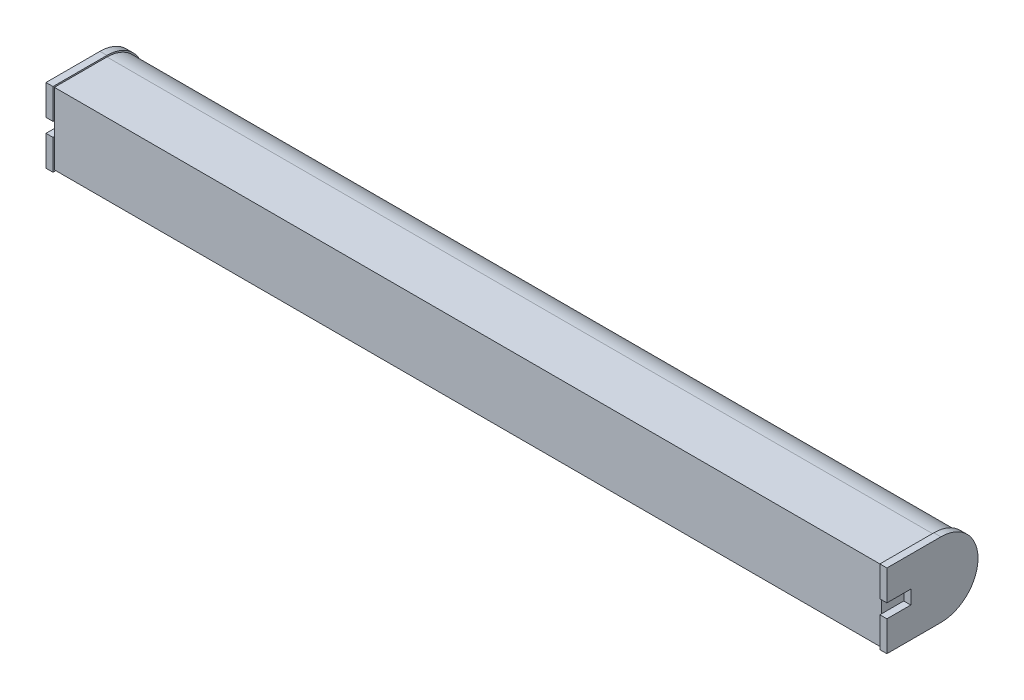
ISO-10303-21;
HEADER;
FILE_DESCRIPTION(('STEP AP214'),'2;1');
FILE_NAME('part.step','',(''),(''),'','','');
FILE_SCHEMA(('AUTOMOTIVE_DESIGN { 1 0 10303 214 1 1 1 1 }'));
ENDSEC;
DATA;
#1=APPLICATION_CONTEXT('core data for automotive mechanical design processes');
#2=APPLICATION_PROTOCOL_DEFINITION('international standard','automotive_design',2000,#1);
#3=PRODUCT_CONTEXT('',#1,'mechanical');
#4=PRODUCT('Part','Part','',(#3));
#5=PRODUCT_RELATED_PRODUCT_CATEGORY('part','',(#4));
#6=PRODUCT_DEFINITION_FORMATION('','',#4);
#7=PRODUCT_DEFINITION_CONTEXT('part definition',#1,'design');
#8=PRODUCT_DEFINITION('design','',#6,#7);
#9=PRODUCT_DEFINITION_SHAPE('','',#8);
#10=(LENGTH_UNIT() NAMED_UNIT(*) SI_UNIT(.MILLI.,.METRE.));
#11=(NAMED_UNIT(*) PLANE_ANGLE_UNIT() SI_UNIT($,.RADIAN.));
#12=(NAMED_UNIT(*) SI_UNIT($,.STERADIAN.) SOLID_ANGLE_UNIT());
#13=UNCERTAINTY_MEASURE_WITH_UNIT(LENGTH_MEASURE(1.E-05),#10,'distance_accuracy_value','');
#14=(GEOMETRIC_REPRESENTATION_CONTEXT(3) GLOBAL_UNCERTAINTY_ASSIGNED_CONTEXT((#13)) GLOBAL_UNIT_ASSIGNED_CONTEXT((#10,
#11,#12)) REPRESENTATION_CONTEXT('',''));
#15=CARTESIAN_POINT('',(0.,0.,0.));
#16=DIRECTION('',(0.,0.,1.));
#17=DIRECTION('',(1.,0.,0.));
#18=AXIS2_PLACEMENT_3D('',#15,#16,#17);
#19=CARTESIAN_POINT('',(5.,0.,-12.7681159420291));
#20=DIRECTION('',(-1.,0.,0.));
#21=DIRECTION('',(0.,0.,1.));
#22=AXIS2_PLACEMENT_3D('',#19,#20,#21);
#23=CYLINDRICAL_SURFACE('',#22,26.5);
#24=CARTESIAN_POINT('',(0.,0.,-12.7681159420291));
#25=DIRECTION('',(1.,0.,0.));
#26=DIRECTION('',(0.,0.,-1.));
#27=AXIS2_PLACEMENT_3D('',#24,#25,#26);
#28=CIRCLE('',#27,26.5);
#29=CARTESIAN_POINT('',(0.,-26.5,-12.7681159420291));
#30=VERTEX_POINT('',#29);
#31=CARTESIAN_POINT('',(0.,26.5,-12.7681159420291));
#32=VERTEX_POINT('',#31);
#33=EDGE_CURVE('E338',#30,#32,#28,.T.);
#34=ORIENTED_EDGE('',*,*,#33,.T.);
#35=DIRECTION('',(-1.,0.,0.));
#36=VECTOR('',#35,1.);
#37=CARTESIAN_POINT('',(5.,26.5,-12.7681159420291));
#38=LINE('',#37,#36);
#39=CARTESIAN_POINT('',(5.,26.5,-12.7681159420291));
#40=VERTEX_POINT('',#39);
#41=EDGE_CURVE('E42',#40,#32,#38,.T.);
#42=ORIENTED_EDGE('',*,*,#41,.F.);
#43=CARTESIAN_POINT('',(5.,0.,-12.7681159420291));
#44=DIRECTION('',(1.,0.,0.));
#45=DIRECTION('',(0.,0.,-1.));
#46=AXIS2_PLACEMENT_3D('',#43,#44,#45);
#47=CIRCLE('',#46,26.5);
#48=CARTESIAN_POINT('',(5.,-26.5,-12.7681159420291));
#49=VERTEX_POINT('',#48);
#50=EDGE_CURVE('E339',#49,#40,#47,.T.);
#51=ORIENTED_EDGE('',*,*,#50,.F.);
#52=DIRECTION('',(-1.,0.,0.));
#53=VECTOR('',#52,1.);
#54=CARTESIAN_POINT('',(5.,-26.5,-12.7681159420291));
#55=LINE('',#54,#53);
#56=EDGE_CURVE('E370',#49,#30,#55,.T.);
#57=ORIENTED_EDGE('',*,*,#56,.T.);
#58=EDGE_LOOP('',(#34,#42,#51,#57));
#59=FACE_BOUND('',#58,.T.);
#60=ADVANCED_FACE('F39',(#59),#23,.T.);
#61=CARTESIAN_POINT('',(5.,26.5,25.7318840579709));
#62=DIRECTION('',(0.,-1.,0.));
#63=DIRECTION('',(0.,0.,-1.));
#64=AXIS2_PLACEMENT_3D('',#61,#62,#63);
#65=PLANE('',#64);
#66=DIRECTION('',(0.,0.,1.));
#67=VECTOR('',#66,1.);
#68=CARTESIAN_POINT('',(0.,26.5,25.7318840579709));
#69=LINE('',#68,#67);
#70=CARTESIAN_POINT('',(0.,26.5,25.7318840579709));
#71=VERTEX_POINT('',#70);
#72=EDGE_CURVE('E374',#32,#71,#69,.T.);
#73=ORIENTED_EDGE('',*,*,#72,.T.);
#74=DIRECTION('',(-1.,0.,0.));
#75=VECTOR('',#74,1.);
#76=CARTESIAN_POINT('',(5.,26.5,25.7318840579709));
#77=LINE('',#76,#75);
#78=CARTESIAN_POINT('',(5.,26.5,25.7318840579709));
#79=VERTEX_POINT('',#78);
#80=EDGE_CURVE('E416',#79,#71,#77,.T.);
#81=ORIENTED_EDGE('',*,*,#80,.F.);
#82=DIRECTION('',(0.,0.,1.));
#83=VECTOR('',#82,1.);
#84=CARTESIAN_POINT('',(5.,26.5,25.7318840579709));
#85=LINE('',#84,#83);
#86=EDGE_CURVE('E343',#40,#79,#85,.T.);
#87=ORIENTED_EDGE('',*,*,#86,.F.);
#88=ORIENTED_EDGE('',*,*,#41,.T.);
#89=EDGE_LOOP('',(#73,#81,#87,#88));
#90=FACE_BOUND('',#89,.T.);
#91=ADVANCED_FACE('F486',(#90),#65,.F.);
#92=CARTESIAN_POINT('',(5.,4.91972353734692,25.7318840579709));
#93=DIRECTION('',(0.,0.,-1.));
#94=DIRECTION('',(-1.,0.,0.));
#95=AXIS2_PLACEMENT_3D('',#92,#93,#94);
#96=PLANE('',#95);
#97=DIRECTION('',(0.,-1.,0.));
#98=VECTOR('',#97,1.);
#99=CARTESIAN_POINT('',(0.,4.91972353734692,25.7318840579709));
#100=LINE('',#99,#98);
#101=CARTESIAN_POINT('',(0.,4.91972353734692,25.7318840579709));
#102=VERTEX_POINT('',#101);
#103=EDGE_CURVE('E377',#71,#102,#100,.T.);
#104=ORIENTED_EDGE('',*,*,#103,.T.);
#105=DIRECTION('',(-1.,0.,0.));
#106=VECTOR('',#105,1.);
#107=CARTESIAN_POINT('',(5.,4.91972353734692,25.7318840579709));
#108=LINE('',#107,#106);
#109=CARTESIAN_POINT('',(5.,4.91972353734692,25.7318840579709));
#110=VERTEX_POINT('',#109);
#111=EDGE_CURVE('E413',#110,#102,#108,.T.);
#112=ORIENTED_EDGE('',*,*,#111,.F.);
#113=DIRECTION('',(0.,-1.,0.));
#114=VECTOR('',#113,1.);
#115=CARTESIAN_POINT('',(5.,4.91972353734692,25.7318840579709));
#116=LINE('',#115,#114);
#117=EDGE_CURVE('E347',#79,#110,#116,.T.);
#118=ORIENTED_EDGE('',*,*,#117,.F.);
#119=ORIENTED_EDGE('',*,*,#80,.T.);
#120=EDGE_LOOP('',(#104,#112,#118,#119));
#121=FACE_BOUND('',#120,.T.);
#122=ADVANCED_FACE('F491',(#121),#96,.F.);
#123=CARTESIAN_POINT('',(5.,4.91972353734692,25.7318840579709));
#124=DIRECTION('',(0.,1.,0.));
#125=DIRECTION('',(0.,0.,1.));
#126=AXIS2_PLACEMENT_3D('',#123,#124,#125);
#127=PLANE('',#126);
#128=DIRECTION('',(0.,0.,-1.));
#129=VECTOR('',#128,1.);
#130=CARTESIAN_POINT('',(0.,4.91972353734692,25.7318840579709));
#131=LINE('',#130,#129);
#132=CARTESIAN_POINT('',(0.,4.91972353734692,8.69894669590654));
#133=VERTEX_POINT('',#132);
#134=EDGE_CURVE('E380',#102,#133,#131,.T.);
#135=ORIENTED_EDGE('',*,*,#134,.T.);
#136=DIRECTION('',(-1.,0.,0.));
#137=VECTOR('',#136,1.);
#138=CARTESIAN_POINT('',(5.,4.91972353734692,8.69894669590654));
#139=LINE('',#138,#137);
#140=CARTESIAN_POINT('',(5.,4.91972353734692,8.69894669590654));
#141=VERTEX_POINT('',#140);
#142=EDGE_CURVE('E409',#141,#133,#139,.T.);
#143=ORIENTED_EDGE('',*,*,#142,.F.);
#144=DIRECTION('',(0.,0.,-1.));
#145=VECTOR('',#144,1.);
#146=CARTESIAN_POINT('',(5.,4.91972353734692,25.7318840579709));
#147=LINE('',#146,#145);
#148=CARTESIAN_POINT('',(5.,4.91972353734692,24.7318840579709));
#149=VERTEX_POINT('',#148);
#150=EDGE_CURVE('E350',#149,#141,#147,.T.);
#151=ORIENTED_EDGE('',*,*,#150,.F.);
#152=EDGE_CURVE('E351',#110,#149,#147,.T.);
#153=ORIENTED_EDGE('',*,*,#152,.F.);
#154=ORIENTED_EDGE('',*,*,#111,.T.);
#155=EDGE_LOOP('',(#135,#143,#151,#153,#154));
#156=FACE_BOUND('',#155,.T.);
#157=ADVANCED_FACE('F513',(#156),#127,.F.);
#158=CARTESIAN_POINT('',(5.,-4.91972353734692,8.69894669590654));
#159=DIRECTION('',(0.,0.,-1.));
#160=DIRECTION('',(-1.,0.,0.));
#161=AXIS2_PLACEMENT_3D('',#158,#159,#160);
#162=PLANE('',#161);
#163=DIRECTION('',(0.,-1.,0.));
#164=VECTOR('',#163,1.);
#165=CARTESIAN_POINT('',(0.,-4.91972353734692,8.69894669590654));
#166=LINE('',#165,#164);
#167=CARTESIAN_POINT('',(0.,-4.91972353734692,8.69894669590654));
#168=VERTEX_POINT('',#167);
#169=EDGE_CURVE('E383',#133,#168,#166,.T.);
#170=ORIENTED_EDGE('',*,*,#169,.T.);
#171=DIRECTION('',(-1.,0.,0.));
#172=VECTOR('',#171,1.);
#173=CARTESIAN_POINT('',(5.,-4.91972353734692,8.69894669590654));
#174=LINE('',#173,#172);
#175=CARTESIAN_POINT('',(5.,-4.91972353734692,8.69894669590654));
#176=VERTEX_POINT('',#175);
#177=EDGE_CURVE('E405',#176,#168,#174,.T.);
#178=ORIENTED_EDGE('',*,*,#177,.F.);
#179=DIRECTION('',(0.,-1.,0.));
#180=VECTOR('',#179,1.);
#181=CARTESIAN_POINT('',(5.,-4.91972353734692,8.69894669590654));
#182=LINE('',#181,#180);
#183=EDGE_CURVE('E355',#141,#176,#182,.T.);
#184=ORIENTED_EDGE('',*,*,#183,.F.);
#185=ORIENTED_EDGE('',*,*,#142,.T.);
#186=EDGE_LOOP('',(#170,#178,#184,#185));
#187=FACE_BOUND('',#186,.T.);
#188=ADVANCED_FACE('F511',(#187),#162,.F.);
#189=CARTESIAN_POINT('',(5.,-4.91972353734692,25.7318840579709));
#190=DIRECTION('',(0.,-1.,0.));
#191=DIRECTION('',(0.,0.,-1.));
#192=AXIS2_PLACEMENT_3D('',#189,#190,#191);
#193=PLANE('',#192);
#194=DIRECTION('',(0.,0.,1.));
#195=VECTOR('',#194,1.);
#196=CARTESIAN_POINT('',(0.,-4.91972353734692,25.7318840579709));
#197=LINE('',#196,#195);
#198=CARTESIAN_POINT('',(0.,-4.91972353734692,25.7318840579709));
#199=VERTEX_POINT('',#198);
#200=EDGE_CURVE('E386',#168,#199,#197,.T.);
#201=ORIENTED_EDGE('',*,*,#200,.T.);
#202=DIRECTION('',(-1.,0.,0.));
#203=VECTOR('',#202,1.);
#204=CARTESIAN_POINT('',(5.,-4.91972353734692,25.7318840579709));
#205=LINE('',#204,#203);
#206=CARTESIAN_POINT('',(5.,-4.91972353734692,25.7318840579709));
#207=VERTEX_POINT('',#206);
#208=EDGE_CURVE('E401',#207,#199,#205,.T.);
#209=ORIENTED_EDGE('',*,*,#208,.F.);
#210=DIRECTION('',(0.,0.,1.));
#211=VECTOR('',#210,1.);
#212=CARTESIAN_POINT('',(5.,-4.91972353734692,25.7318840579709));
#213=LINE('',#212,#211);
#214=CARTESIAN_POINT('',(5.,-4.91972353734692,24.7318840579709));
#215=VERTEX_POINT('',#214);
#216=EDGE_CURVE('E359',#215,#207,#213,.T.);
#217=ORIENTED_EDGE('',*,*,#216,.F.);
#218=EDGE_CURVE('E360',#176,#215,#213,.T.);
#219=ORIENTED_EDGE('',*,*,#218,.F.);
#220=ORIENTED_EDGE('',*,*,#177,.T.);
#221=EDGE_LOOP('',(#201,#209,#217,#219,#220));
#222=FACE_BOUND('',#221,.T.);
#223=ADVANCED_FACE('F440',(#222),#193,.F.);
#224=CARTESIAN_POINT('',(5.,-26.5,25.7318840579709));
#225=DIRECTION('',(0.,0.,-1.));
#226=DIRECTION('',(-1.,0.,0.));
#227=AXIS2_PLACEMENT_3D('',#224,#225,#226);
#228=PLANE('',#227);
#229=DIRECTION('',(0.,-1.,0.));
#230=VECTOR('',#229,1.);
#231=CARTESIAN_POINT('',(0.,-26.5,25.7318840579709));
#232=LINE('',#231,#230);
#233=CARTESIAN_POINT('',(0.,-26.5,25.7318840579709));
#234=VERTEX_POINT('',#233);
#235=EDGE_CURVE('E389',#199,#234,#232,.T.);
#236=ORIENTED_EDGE('',*,*,#235,.T.);
#237=DIRECTION('',(-1.,0.,0.));
#238=VECTOR('',#237,1.);
#239=CARTESIAN_POINT('',(5.,-26.5,25.7318840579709));
#240=LINE('',#239,#238);
#241=CARTESIAN_POINT('',(5.,-26.5,25.7318840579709));
#242=VERTEX_POINT('',#241);
#243=EDGE_CURVE('E397',#242,#234,#240,.T.);
#244=ORIENTED_EDGE('',*,*,#243,.F.);
#245=DIRECTION('',(0.,-1.,0.));
#246=VECTOR('',#245,1.);
#247=CARTESIAN_POINT('',(5.,-26.5,25.7318840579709));
#248=LINE('',#247,#246);
#249=EDGE_CURVE('E364',#207,#242,#248,.T.);
#250=ORIENTED_EDGE('',*,*,#249,.F.);
#251=ORIENTED_EDGE('',*,*,#208,.T.);
#252=EDGE_LOOP('',(#236,#244,#250,#251));
#253=FACE_BOUND('',#252,.T.);
#254=ADVANCED_FACE('F508',(#253),#228,.F.);
#255=CARTESIAN_POINT('',(5.,-26.5,25.7318840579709));
#256=DIRECTION('',(0.,1.,0.));
#257=DIRECTION('',(0.,0.,1.));
#258=AXIS2_PLACEMENT_3D('',#255,#256,#257);
#259=PLANE('',#258);
#260=DIRECTION('',(0.,0.,-1.));
#261=VECTOR('',#260,1.);
#262=CARTESIAN_POINT('',(0.,-26.5,25.7318840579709));
#263=LINE('',#262,#261);
#264=EDGE_CURVE('E344',#234,#30,#263,.T.);
#265=ORIENTED_EDGE('',*,*,#264,.T.);
#266=ORIENTED_EDGE('',*,*,#56,.F.);
#267=DIRECTION('',(0.,0.,-1.));
#268=VECTOR('',#267,1.);
#269=CARTESIAN_POINT('',(5.,-26.5,25.7318840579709));
#270=LINE('',#269,#268);
#271=EDGE_CURVE('E367',#242,#49,#270,.T.);
#272=ORIENTED_EDGE('',*,*,#271,.F.);
#273=ORIENTED_EDGE('',*,*,#243,.T.);
#274=EDGE_LOOP('',(#265,#266,#272,#273));
#275=FACE_BOUND('',#274,.T.);
#276=ADVANCED_FACE('F506',(#275),#259,.F.);
#277=CARTESIAN_POINT('',(5.,0.,-12.7681159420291));
#278=DIRECTION('',(1.,0.,0.));
#279=DIRECTION('',(0.,0.,-1.));
#280=AXIS2_PLACEMENT_3D('',#277,#278,#279);
#281=PLANE('',#280);
#282=DIRECTION('',(0.,-1.,0.));
#283=VECTOR('',#282,1.);
#284=CARTESIAN_POINT('',(5.,-5.91972353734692,24.7318840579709));
#285=LINE('',#284,#283);
#286=CARTESIAN_POINT('',(5.,-25.5,24.7318840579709));
#287=VERTEX_POINT('',#286);
#288=EDGE_CURVE('E48',#215,#287,#285,.T.);
#289=ORIENTED_EDGE('',*,*,#288,.F.);
#290=ORIENTED_EDGE('',*,*,#216,.T.);
#291=ORIENTED_EDGE('',*,*,#249,.T.);
#292=ORIENTED_EDGE('',*,*,#271,.T.);
#293=ORIENTED_EDGE('',*,*,#50,.T.);
#294=ORIENTED_EDGE('',*,*,#86,.T.);
#295=ORIENTED_EDGE('',*,*,#117,.T.);
#296=ORIENTED_EDGE('',*,*,#152,.T.);
#297=CARTESIAN_POINT('',(5.,25.5,24.7318840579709));
#298=VERTEX_POINT('',#297);
#299=EDGE_CURVE('E316',#298,#149,#285,.T.);
#300=ORIENTED_EDGE('',*,*,#299,.F.);
#301=DIRECTION('',(0.,0.,1.));
#302=VECTOR('',#301,1.);
#303=CARTESIAN_POINT('',(5.,25.5,-12.7681159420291));
#304=LINE('',#303,#302);
#305=CARTESIAN_POINT('',(5.,25.5,-12.7681159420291));
#306=VERTEX_POINT('',#305);
#307=EDGE_CURVE('E311',#306,#298,#304,.T.);
#308=ORIENTED_EDGE('',*,*,#307,.F.);
#309=CARTESIAN_POINT('',(5.,0.,-12.7681159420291));
#310=DIRECTION('',(1.,0.,0.));
#311=DIRECTION('',(0.,0.,-1.));
#312=AXIS2_PLACEMENT_3D('',#309,#310,#311);
#313=CIRCLE('',#312,25.5);
#314=CARTESIAN_POINT('',(5.,-25.5,-12.7681159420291));
#315=VERTEX_POINT('',#314);
#316=EDGE_CURVE('E204',#315,#306,#313,.T.);
#317=ORIENTED_EDGE('',*,*,#316,.F.);
#318=DIRECTION('',(0.,0.,-1.));
#319=VECTOR('',#318,1.);
#320=CARTESIAN_POINT('',(5.,-25.5,24.7318840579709));
#321=LINE('',#320,#319);
#322=EDGE_CURVE('E295',#287,#315,#321,.T.);
#323=ORIENTED_EDGE('',*,*,#322,.F.);
#324=EDGE_LOOP('',(#289,#290,#291,#292,#293,#294,#295,#296,#300,#308,#317,#323));
#325=FACE_BOUND('',#324,.T.);
#326=ADVANCED_FACE('F502',(#325),#281,.T.);
#327=CARTESIAN_POINT('',(0.,0.,-12.7681159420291));
#328=DIRECTION('',(1.,0.,0.));
#329=DIRECTION('',(0.,0.,-1.));
#330=AXIS2_PLACEMENT_3D('',#327,#328,#329);
#331=PLANE('',#330);
#332=ORIENTED_EDGE('',*,*,#33,.F.);
#333=ORIENTED_EDGE('',*,*,#264,.F.);
#334=ORIENTED_EDGE('',*,*,#235,.F.);
#335=ORIENTED_EDGE('',*,*,#200,.F.);
#336=ORIENTED_EDGE('',*,*,#169,.F.);
#337=ORIENTED_EDGE('',*,*,#134,.F.);
#338=ORIENTED_EDGE('',*,*,#103,.F.);
#339=ORIENTED_EDGE('',*,*,#72,.F.);
#340=EDGE_LOOP('',(#332,#333,#334,#335,#336,#337,#338,#339));
#341=FACE_BOUND('',#340,.T.);
#342=ADVANCED_FACE('F497',(#341),#331,.F.);
#343=CARTESIAN_POINT('',(5.,0.,-12.7681159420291));
#344=DIRECTION('',(1.,0.,0.));
#345=DIRECTION('',(0.,0.,-1.));
#346=AXIS2_PLACEMENT_3D('',#343,#344,#345);
#347=PLANE('',#346);
#348=EDGE_CURVE('E315',#149,#215,#285,.T.);
#349=ORIENTED_EDGE('',*,*,#348,.F.);
#350=ORIENTED_EDGE('',*,*,#150,.T.);
#351=ORIENTED_EDGE('',*,*,#183,.T.);
#352=ORIENTED_EDGE('',*,*,#218,.T.);
#353=EDGE_LOOP('',(#349,#350,#351,#352));
#354=FACE_BOUND('',#353,.T.);
#355=ADVANCED_FACE('F435',(#354),#347,.F.);
#356=CARTESIAN_POINT('',(595.,0.,-12.7681159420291));
#357=DIRECTION('',(-1.,0.,0.));
#358=DIRECTION('',(0.,0.,1.));
#359=AXIS2_PLACEMENT_3D('',#356,#357,#358);
#360=CYLINDRICAL_SURFACE('',#359,25.5);
#361=ORIENTED_EDGE('',*,*,#316,.T.);
#362=DIRECTION('',(-1.,0.,0.));
#363=VECTOR('',#362,1.);
#364=CARTESIAN_POINT('',(595.,25.5,-12.7681159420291));
#365=LINE('',#364,#363);
#366=CARTESIAN_POINT('',(595.,25.5,-12.7681159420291));
#367=VERTEX_POINT('',#366);
#368=EDGE_CURVE('E334',#367,#306,#365,.T.);
#369=ORIENTED_EDGE('',*,*,#368,.F.);
#370=CARTESIAN_POINT('',(595.,0.,-12.7681159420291));
#371=DIRECTION('',(1.,0.,0.));
#372=DIRECTION('',(0.,0.,-1.));
#373=AXIS2_PLACEMENT_3D('',#370,#371,#372);
#374=CIRCLE('',#373,25.5);
#375=CARTESIAN_POINT('',(595.,-25.5,-12.7681159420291));
#376=VERTEX_POINT('',#375);
#377=EDGE_CURVE('E290',#376,#367,#374,.T.);
#378=ORIENTED_EDGE('',*,*,#377,.F.);
#379=DIRECTION('',(-1.,0.,0.));
#380=VECTOR('',#379,1.);
#381=CARTESIAN_POINT('',(595.,-25.5,-12.7681159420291));
#382=LINE('',#381,#380);
#383=EDGE_CURVE('E307',#376,#315,#382,.T.);
#384=ORIENTED_EDGE('',*,*,#383,.T.);
#385=EDGE_LOOP('',(#361,#369,#378,#384));
#386=FACE_BOUND('',#385,.T.);
#387=ADVANCED_FACE('F533',(#386),#360,.T.);
#388=CARTESIAN_POINT('',(595.,25.5,-12.7681159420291));
#389=DIRECTION('',(0.,-1.,0.));
#390=DIRECTION('',(0.,0.,-1.));
#391=AXIS2_PLACEMENT_3D('',#388,#389,#390);
#392=PLANE('',#391);
#393=ORIENTED_EDGE('',*,*,#307,.T.);
#394=DIRECTION('',(-1.,0.,0.));
#395=VECTOR('',#394,1.);
#396=CARTESIAN_POINT('',(595.,25.5,24.7318840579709));
#397=LINE('',#396,#395);
#398=CARTESIAN_POINT('',(595.,25.5,24.7318840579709));
#399=VERTEX_POINT('',#398);
#400=EDGE_CURVE('E330',#399,#298,#397,.T.);
#401=ORIENTED_EDGE('',*,*,#400,.F.);
#402=DIRECTION('',(0.,0.,1.));
#403=VECTOR('',#402,1.);
#404=CARTESIAN_POINT('',(595.,25.5,-12.7681159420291));
#405=LINE('',#404,#403);
#406=EDGE_CURVE('E294',#367,#399,#405,.T.);
#407=ORIENTED_EDGE('',*,*,#406,.F.);
#408=ORIENTED_EDGE('',*,*,#368,.T.);
#409=EDGE_LOOP('',(#393,#401,#407,#408));
#410=FACE_BOUND('',#409,.T.);
#411=ADVANCED_FACE('F536',(#410),#392,.F.);
#412=CARTESIAN_POINT('',(595.,-5.91972353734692,24.7318840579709));
#413=DIRECTION('',(0.,0.,-1.));
#414=DIRECTION('',(-1.,0.,0.));
#415=AXIS2_PLACEMENT_3D('',#412,#413,#414);
#416=PLANE('',#415);
#417=ORIENTED_EDGE('',*,*,#299,.T.);
#418=ORIENTED_EDGE('',*,*,#348,.T.);
#419=ORIENTED_EDGE('',*,*,#288,.T.);
#420=DIRECTION('',(-1.,0.,0.));
#421=VECTOR('',#420,1.);
#422=CARTESIAN_POINT('',(595.,-25.5,24.7318840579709));
#423=LINE('',#422,#421);
#424=CARTESIAN_POINT('',(595.,-25.5,24.7318840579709));
#425=VERTEX_POINT('',#424);
#426=EDGE_CURVE('E326',#425,#287,#423,.T.);
#427=ORIENTED_EDGE('',*,*,#426,.F.);
#428=DIRECTION('',(0.,-1.,0.));
#429=VECTOR('',#428,1.);
#430=CARTESIAN_POINT('',(595.,25.5,24.7318840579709));
#431=LINE('',#430,#429);
#432=CARTESIAN_POINT('',(595.,-4.91972353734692,24.7318840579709));
#433=VERTEX_POINT('',#432);
#434=EDGE_CURVE('E65',#433,#425,#431,.T.);
#435=ORIENTED_EDGE('',*,*,#434,.F.);
#436=CARTESIAN_POINT('',(595.,4.91972353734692,24.7318840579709));
#437=VERTEX_POINT('',#436);
#438=EDGE_CURVE('E303',#437,#433,#431,.T.);
#439=ORIENTED_EDGE('',*,*,#438,.F.);
#440=EDGE_CURVE('E298',#399,#437,#431,.T.);
#441=ORIENTED_EDGE('',*,*,#440,.F.);
#442=ORIENTED_EDGE('',*,*,#400,.T.);
#443=EDGE_LOOP('',(#417,#418,#419,#427,#435,#439,#441,#442));
#444=FACE_BOUND('',#443,.T.);
#445=ADVANCED_FACE('F432',(#444),#416,.F.);
#446=CARTESIAN_POINT('',(595.,-25.5,24.7318840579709));
#447=DIRECTION('',(0.,1.,0.));
#448=DIRECTION('',(0.,0.,1.));
#449=AXIS2_PLACEMENT_3D('',#446,#447,#448);
#450=PLANE('',#449);
#451=ORIENTED_EDGE('',*,*,#322,.T.);
#452=ORIENTED_EDGE('',*,*,#383,.F.);
#453=DIRECTION('',(0.,0.,-1.));
#454=VECTOR('',#453,1.);
#455=CARTESIAN_POINT('',(595.,-25.5,24.7318840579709));
#456=LINE('',#455,#454);
#457=EDGE_CURVE('E302',#425,#376,#456,.T.);
#458=ORIENTED_EDGE('',*,*,#457,.F.);
#459=ORIENTED_EDGE('',*,*,#426,.T.);
#460=EDGE_LOOP('',(#451,#452,#458,#459));
#461=FACE_BOUND('',#460,.T.);
#462=ADVANCED_FACE('F543',(#461),#450,.F.);
#463=CARTESIAN_POINT('',(595.,0.,-12.7681159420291));
#464=DIRECTION('',(1.,0.,0.));
#465=DIRECTION('',(0.,0.,-1.));
#466=AXIS2_PLACEMENT_3D('',#463,#464,#465);
#467=PLANE('',#466);
#468=DIRECTION('',(0.,0.,1.));
#469=VECTOR('',#468,1.);
#470=CARTESIAN_POINT('',(595.,-4.91972353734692,25.7318840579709));
#471=LINE('',#470,#469);
#472=CARTESIAN_POINT('',(595.,-4.91972353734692,8.69894669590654));
#473=VERTEX_POINT('',#472);
#474=EDGE_CURVE('E57',#473,#433,#471,.T.);
#475=ORIENTED_EDGE('',*,*,#474,.F.);
#476=DIRECTION('',(0.,-1.,0.));
#477=VECTOR('',#476,1.);
#478=CARTESIAN_POINT('',(595.,-4.91972353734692,8.69894669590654));
#479=LINE('',#478,#477);
#480=CARTESIAN_POINT('',(595.,4.91972353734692,8.69894669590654));
#481=VERTEX_POINT('',#480);
#482=EDGE_CURVE('E230',#481,#473,#479,.T.);
#483=ORIENTED_EDGE('',*,*,#482,.F.);
#484=DIRECTION('',(0.,0.,-1.));
#485=VECTOR('',#484,1.);
#486=CARTESIAN_POINT('',(595.,4.91972353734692,25.7318840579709));
#487=LINE('',#486,#485);
#488=EDGE_CURVE('E11',#437,#481,#487,.T.);
#489=ORIENTED_EDGE('',*,*,#488,.F.);
#490=ORIENTED_EDGE('',*,*,#438,.T.);
#491=EDGE_LOOP('',(#475,#483,#489,#490));
#492=FACE_BOUND('',#491,.T.);
#493=ADVANCED_FACE('F460',(#492),#467,.T.);
#494=CARTESIAN_POINT('',(595.,0.,-12.7681159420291));
#495=DIRECTION('',(1.,0.,0.));
#496=DIRECTION('',(0.,0.,-1.));
#497=AXIS2_PLACEMENT_3D('',#494,#495,#496);
#498=CYLINDRICAL_SURFACE('',#497,26.5);
#499=CARTESIAN_POINT('',(600.,0.,-12.7681159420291));
#500=DIRECTION('',(1.,0.,0.));
#501=DIRECTION('',(0.,0.,-1.));
#502=AXIS2_PLACEMENT_3D('',#499,#500,#501);
#503=CIRCLE('',#502,26.5);
#504=CARTESIAN_POINT('',(600.,-26.5,-12.7681159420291));
#505=VERTEX_POINT('',#504);
#506=CARTESIAN_POINT('',(600.,26.5,-12.7681159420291));
#507=VERTEX_POINT('',#506);
#508=EDGE_CURVE('E198',#505,#507,#503,.T.);
#509=ORIENTED_EDGE('',*,*,#508,.F.);
#510=DIRECTION('',(1.,0.,0.));
#511=VECTOR('',#510,1.);
#512=CARTESIAN_POINT('',(595.,-26.5,-12.7681159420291));
#513=LINE('',#512,#511);
#514=CARTESIAN_POINT('',(595.,-26.5,-12.7681159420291));
#515=VERTEX_POINT('',#514);
#516=EDGE_CURVE('E192',#515,#505,#513,.T.);
#517=ORIENTED_EDGE('',*,*,#516,.F.);
#518=CARTESIAN_POINT('',(595.,0.,-12.7681159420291));
#519=DIRECTION('',(1.,0.,0.));
#520=DIRECTION('',(0.,0.,-1.));
#521=AXIS2_PLACEMENT_3D('',#518,#519,#520);
#522=CIRCLE('',#521,26.5);
#523=CARTESIAN_POINT('',(595.,26.5,-12.7681159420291));
#524=VERTEX_POINT('',#523);
#525=EDGE_CURVE('E195',#515,#524,#522,.T.);
#526=ORIENTED_EDGE('',*,*,#525,.T.);
#527=DIRECTION('',(1.,0.,0.));
#528=VECTOR('',#527,1.);
#529=CARTESIAN_POINT('',(595.,26.5,-12.7681159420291));
#530=LINE('',#529,#528);
#531=EDGE_CURVE('E242',#524,#507,#530,.T.);
#532=ORIENTED_EDGE('',*,*,#531,.T.);
#533=EDGE_LOOP('',(#509,#517,#526,#532));
#534=FACE_BOUND('',#533,.T.);
#535=ADVANCED_FACE('F194',(#534),#498,.T.);
#536=CARTESIAN_POINT('',(595.,-26.5,25.7318840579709));
#537=DIRECTION('',(0.,-1.,0.));
#538=DIRECTION('',(0.,0.,-1.));
#539=AXIS2_PLACEMENT_3D('',#536,#537,#538);
#540=PLANE('',#539);
#541=DIRECTION('',(0.,0.,-1.));
#542=VECTOR('',#541,1.);
#543=CARTESIAN_POINT('',(600.,-26.5,25.7318840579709));
#544=LINE('',#543,#542);
#545=CARTESIAN_POINT('',(600.,-26.5,25.7318840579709));
#546=VERTEX_POINT('',#545);
#547=EDGE_CURVE('E245',#546,#505,#544,.T.);
#548=ORIENTED_EDGE('',*,*,#547,.F.);
#549=DIRECTION('',(1.,0.,0.));
#550=VECTOR('',#549,1.);
#551=CARTESIAN_POINT('',(595.,-26.5,25.7318840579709));
#552=LINE('',#551,#550);
#553=CARTESIAN_POINT('',(595.,-26.5,25.7318840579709));
#554=VERTEX_POINT('',#553);
#555=EDGE_CURVE('E205',#554,#546,#552,.T.);
#556=ORIENTED_EDGE('',*,*,#555,.F.);
#557=DIRECTION('',(0.,0.,-1.));
#558=VECTOR('',#557,1.);
#559=CARTESIAN_POINT('',(595.,-26.5,25.7318840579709));
#560=LINE('',#559,#558);
#561=EDGE_CURVE('E212',#554,#515,#560,.T.);
#562=ORIENTED_EDGE('',*,*,#561,.T.);
#563=ORIENTED_EDGE('',*,*,#516,.T.);
#564=EDGE_LOOP('',(#548,#556,#562,#563));
#565=FACE_BOUND('',#564,.T.);
#566=ADVANCED_FACE('F220',(#565),#540,.T.);
#567=CARTESIAN_POINT('',(595.,-26.5,25.7318840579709));
#568=DIRECTION('',(0.,0.,1.));
#569=DIRECTION('',(1.,0.,0.));
#570=AXIS2_PLACEMENT_3D('',#567,#568,#569);
#571=PLANE('',#570);
#572=DIRECTION('',(0.,-1.,0.));
#573=VECTOR('',#572,1.);
#574=CARTESIAN_POINT('',(600.,-26.5,25.7318840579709));
#575=LINE('',#574,#573);
#576=CARTESIAN_POINT('',(600.,-4.91972353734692,25.7318840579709));
#577=VERTEX_POINT('',#576);
#578=EDGE_CURVE('E248',#577,#546,#575,.T.);
#579=ORIENTED_EDGE('',*,*,#578,.F.);
#580=DIRECTION('',(1.,0.,0.));
#581=VECTOR('',#580,1.);
#582=CARTESIAN_POINT('',(595.,-4.91972353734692,25.7318840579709));
#583=LINE('',#582,#581);
#584=CARTESIAN_POINT('',(595.,-4.91972353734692,25.7318840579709));
#585=VERTEX_POINT('',#584);
#586=EDGE_CURVE('E285',#585,#577,#583,.T.);
#587=ORIENTED_EDGE('',*,*,#586,.F.);
#588=DIRECTION('',(0.,-1.,0.));
#589=VECTOR('',#588,1.);
#590=CARTESIAN_POINT('',(595.,-26.5,25.7318840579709));
#591=LINE('',#590,#589);
#592=EDGE_CURVE('E222',#585,#554,#591,.T.);
#593=ORIENTED_EDGE('',*,*,#592,.T.);
#594=ORIENTED_EDGE('',*,*,#555,.T.);
#595=EDGE_LOOP('',(#579,#587,#593,#594));
#596=FACE_BOUND('',#595,.T.);
#597=ADVANCED_FACE('F476',(#596),#571,.T.);
#598=CARTESIAN_POINT('',(595.,-4.91972353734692,25.7318840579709));
#599=DIRECTION('',(0.,1.,0.));
#600=DIRECTION('',(0.,0.,1.));
#601=AXIS2_PLACEMENT_3D('',#598,#599,#600);
#602=PLANE('',#601);
#603=DIRECTION('',(0.,0.,1.));
#604=VECTOR('',#603,1.);
#605=CARTESIAN_POINT('',(600.,-4.91972353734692,25.7318840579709));
#606=LINE('',#605,#604);
#607=CARTESIAN_POINT('',(600.,-4.91972353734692,8.69894669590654));
#608=VERTEX_POINT('',#607);
#609=EDGE_CURVE('E252',#608,#577,#606,.T.);
#610=ORIENTED_EDGE('',*,*,#609,.F.);
#611=DIRECTION('',(1.,0.,0.));
#612=VECTOR('',#611,1.);
#613=CARTESIAN_POINT('',(595.,-4.91972353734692,8.69894669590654));
#614=LINE('',#613,#612);
#615=EDGE_CURVE('E282',#473,#608,#614,.T.);
#616=ORIENTED_EDGE('',*,*,#615,.F.);
#617=ORIENTED_EDGE('',*,*,#474,.T.);
#618=EDGE_CURVE('E225',#433,#585,#471,.T.);
#619=ORIENTED_EDGE('',*,*,#618,.T.);
#620=ORIENTED_EDGE('',*,*,#586,.T.);
#621=EDGE_LOOP('',(#610,#616,#617,#619,#620));
#622=FACE_BOUND('',#621,.T.);
#623=ADVANCED_FACE('F455',(#622),#602,.T.);
#624=CARTESIAN_POINT('',(595.,-4.91972353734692,8.69894669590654));
#625=DIRECTION('',(0.,0.,1.));
#626=DIRECTION('',(1.,0.,0.));
#627=AXIS2_PLACEMENT_3D('',#624,#625,#626);
#628=PLANE('',#627);
#629=DIRECTION('',(0.,-1.,0.));
#630=VECTOR('',#629,1.);
#631=CARTESIAN_POINT('',(600.,-4.91972353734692,8.69894669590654));
#632=LINE('',#631,#630);
#633=CARTESIAN_POINT('',(600.,4.91972353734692,8.69894669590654));
#634=VERTEX_POINT('',#633);
#635=EDGE_CURVE('E256',#634,#608,#632,.T.);
#636=ORIENTED_EDGE('',*,*,#635,.F.);
#637=DIRECTION('',(1.,0.,0.));
#638=VECTOR('',#637,1.);
#639=CARTESIAN_POINT('',(595.,4.91972353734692,8.69894669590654));
#640=LINE('',#639,#638);
#641=EDGE_CURVE('E279',#481,#634,#640,.T.);
#642=ORIENTED_EDGE('',*,*,#641,.F.);
#643=ORIENTED_EDGE('',*,*,#482,.T.);
#644=ORIENTED_EDGE('',*,*,#615,.T.);
#645=EDGE_LOOP('',(#636,#642,#643,#644));
#646=FACE_BOUND('',#645,.T.);
#647=ADVANCED_FACE('F459',(#646),#628,.T.);
#648=CARTESIAN_POINT('',(595.,4.91972353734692,25.7318840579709));
#649=DIRECTION('',(0.,-1.,0.));
#650=DIRECTION('',(0.,0.,-1.));
#651=AXIS2_PLACEMENT_3D('',#648,#649,#650);
#652=PLANE('',#651);
#653=DIRECTION('',(0.,0.,-1.));
#654=VECTOR('',#653,1.);
#655=CARTESIAN_POINT('',(600.,4.91972353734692,25.7318840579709));
#656=LINE('',#655,#654);
#657=CARTESIAN_POINT('',(600.,4.91972353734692,25.7318840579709));
#658=VERTEX_POINT('',#657);
#659=EDGE_CURVE('E260',#658,#634,#656,.T.);
#660=ORIENTED_EDGE('',*,*,#659,.F.);
#661=DIRECTION('',(1.,0.,0.));
#662=VECTOR('',#661,1.);
#663=CARTESIAN_POINT('',(595.,4.91972353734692,25.7318840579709));
#664=LINE('',#663,#662);
#665=CARTESIAN_POINT('',(595.,4.91972353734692,25.7318840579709));
#666=VERTEX_POINT('',#665);
#667=EDGE_CURVE('E276',#666,#658,#664,.T.);
#668=ORIENTED_EDGE('',*,*,#667,.F.);
#669=EDGE_CURVE('E50',#666,#437,#487,.T.);
#670=ORIENTED_EDGE('',*,*,#669,.T.);
#671=ORIENTED_EDGE('',*,*,#488,.T.);
#672=ORIENTED_EDGE('',*,*,#641,.T.);
#673=EDGE_LOOP('',(#660,#668,#670,#671,#672));
#674=FACE_BOUND('',#673,.T.);
#675=ADVANCED_FACE('F463',(#674),#652,.T.);
#676=CARTESIAN_POINT('',(595.,4.91972353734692,25.7318840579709));
#677=DIRECTION('',(0.,0.,1.));
#678=DIRECTION('',(1.,0.,0.));
#679=AXIS2_PLACEMENT_3D('',#676,#677,#678);
#680=PLANE('',#679);
#681=DIRECTION('',(0.,-1.,0.));
#682=VECTOR('',#681,1.);
#683=CARTESIAN_POINT('',(600.,4.91972353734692,25.7318840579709));
#684=LINE('',#683,#682);
#685=CARTESIAN_POINT('',(600.,26.5,25.7318840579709));
#686=VERTEX_POINT('',#685);
#687=EDGE_CURVE('E264',#686,#658,#684,.T.);
#688=ORIENTED_EDGE('',*,*,#687,.F.);
#689=DIRECTION('',(1.,0.,0.));
#690=VECTOR('',#689,1.);
#691=CARTESIAN_POINT('',(595.,26.5,25.7318840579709));
#692=LINE('',#691,#690);
#693=CARTESIAN_POINT('',(595.,26.5,25.7318840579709));
#694=VERTEX_POINT('',#693);
#695=EDGE_CURVE('E273',#694,#686,#692,.T.);
#696=ORIENTED_EDGE('',*,*,#695,.F.);
#697=DIRECTION('',(0.,-1.,0.));
#698=VECTOR('',#697,1.);
#699=CARTESIAN_POINT('',(595.,4.91972353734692,25.7318840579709));
#700=LINE('',#699,#698);
#701=EDGE_CURVE('E236',#694,#666,#700,.T.);
#702=ORIENTED_EDGE('',*,*,#701,.T.);
#703=ORIENTED_EDGE('',*,*,#667,.T.);
#704=EDGE_LOOP('',(#688,#696,#702,#703));
#705=FACE_BOUND('',#704,.T.);
#706=ADVANCED_FACE('F468',(#705),#680,.T.);
#707=CARTESIAN_POINT('',(595.,26.5,25.7318840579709));
#708=DIRECTION('',(0.,1.,0.));
#709=DIRECTION('',(0.,0.,1.));
#710=AXIS2_PLACEMENT_3D('',#707,#708,#709);
#711=PLANE('',#710);
#712=DIRECTION('',(0.,0.,1.));
#713=VECTOR('',#712,1.);
#714=CARTESIAN_POINT('',(600.,26.5,25.7318840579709));
#715=LINE('',#714,#713);
#716=EDGE_CURVE('E218',#507,#686,#715,.T.);
#717=ORIENTED_EDGE('',*,*,#716,.F.);
#718=ORIENTED_EDGE('',*,*,#531,.F.);
#719=DIRECTION('',(0.,0.,1.));
#720=VECTOR('',#719,1.);
#721=CARTESIAN_POINT('',(595.,26.5,25.7318840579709));
#722=LINE('',#721,#720);
#723=EDGE_CURVE('E216',#524,#694,#722,.T.);
#724=ORIENTED_EDGE('',*,*,#723,.T.);
#725=ORIENTED_EDGE('',*,*,#695,.T.);
#726=EDGE_LOOP('',(#717,#718,#724,#725));
#727=FACE_BOUND('',#726,.T.);
#728=ADVANCED_FACE('F471',(#727),#711,.T.);
#729=CARTESIAN_POINT('',(595.,0.,-12.7681159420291));
#730=DIRECTION('',(-1.,0.,0.));
#731=DIRECTION('',(0.,0.,-1.));
#732=AXIS2_PLACEMENT_3D('',#729,#730,#731);
#733=PLANE('',#732);
#734=ORIENTED_EDGE('',*,*,#406,.T.);
#735=ORIENTED_EDGE('',*,*,#440,.T.);
#736=ORIENTED_EDGE('',*,*,#669,.F.);
#737=ORIENTED_EDGE('',*,*,#701,.F.);
#738=ORIENTED_EDGE('',*,*,#723,.F.);
#739=ORIENTED_EDGE('',*,*,#525,.F.);
#740=ORIENTED_EDGE('',*,*,#561,.F.);
#741=ORIENTED_EDGE('',*,*,#592,.F.);
#742=ORIENTED_EDGE('',*,*,#618,.F.);
#743=ORIENTED_EDGE('',*,*,#434,.T.);
#744=ORIENTED_EDGE('',*,*,#457,.T.);
#745=ORIENTED_EDGE('',*,*,#377,.T.);
#746=EDGE_LOOP('',(#734,#735,#736,#737,#738,#739,#740,#741,#742,#743,#744,#745));
#747=FACE_BOUND('',#746,.T.);
#748=ADVANCED_FACE('F210',(#747),#733,.T.);
#749=CARTESIAN_POINT('',(600.,0.,-12.7681159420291));
#750=DIRECTION('',(-1.,0.,0.));
#751=DIRECTION('',(0.,0.,-1.));
#752=AXIS2_PLACEMENT_3D('',#749,#750,#751);
#753=PLANE('',#752);
#754=ORIENTED_EDGE('',*,*,#508,.T.);
#755=ORIENTED_EDGE('',*,*,#716,.T.);
#756=ORIENTED_EDGE('',*,*,#687,.T.);
#757=ORIENTED_EDGE('',*,*,#659,.T.);
#758=ORIENTED_EDGE('',*,*,#635,.T.);
#759=ORIENTED_EDGE('',*,*,#609,.T.);
#760=ORIENTED_EDGE('',*,*,#578,.T.);
#761=ORIENTED_EDGE('',*,*,#547,.T.);
#762=EDGE_LOOP('',(#754,#755,#756,#757,#758,#759,#760,#761));
#763=FACE_BOUND('',#762,.T.);
#764=ADVANCED_FACE('F473',(#763),#753,.F.);
#765=CLOSED_SHELL('',(#60,#91,#122,#157,#188,#223,#254,#276,#326,#342,#355,#387,#411,#445,#462,
#493,#535,#566,#597,#623,#647,#675,#706,#728,#748,#764));
#766=MANIFOLD_SOLID_BREP('B2',#765);
#767=ADVANCED_BREP_SHAPE_REPRESENTATION('',(#18,#766),#14);
#768=SHAPE_DEFINITION_REPRESENTATION(#9,#767);
ENDSEC;
END-ISO-10303-21;
